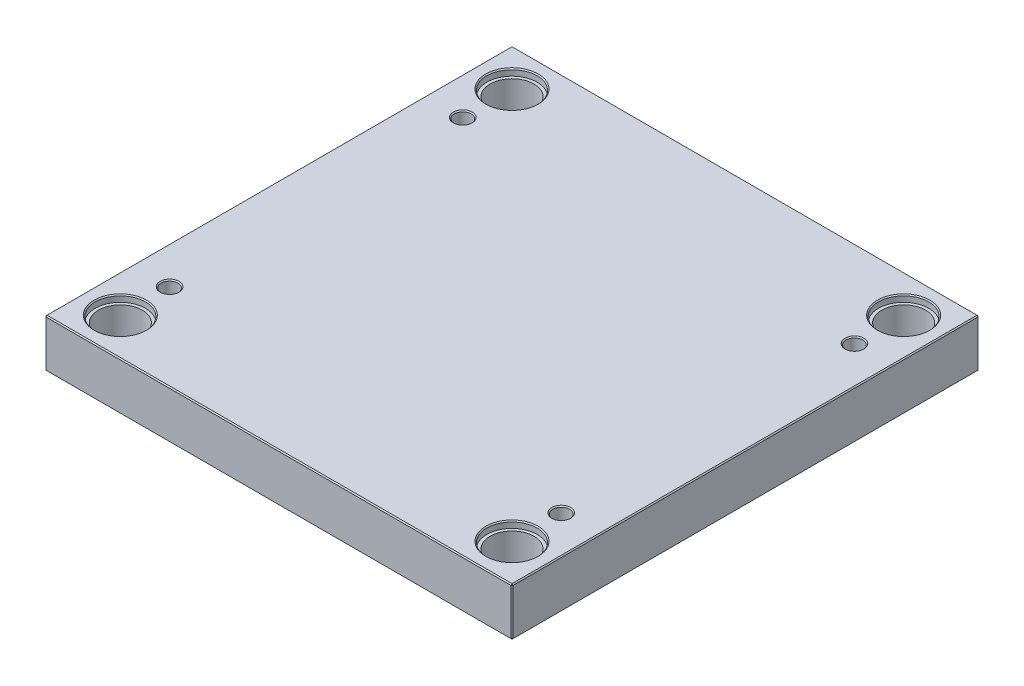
ISO-10303-21;
HEADER;
FILE_DESCRIPTION(('STEP AP214'),'2;1');
FILE_NAME('part.step','',(''),(''),'','','');
FILE_SCHEMA(('AUTOMOTIVE_DESIGN { 1 0 10303 214 1 1 1 1 }'));
ENDSEC;
DATA;
#1=APPLICATION_CONTEXT('core data for automotive mechanical design processes');
#2=APPLICATION_PROTOCOL_DEFINITION('international standard','automotive_design',2000,#1);
#3=PRODUCT_CONTEXT('',#1,'mechanical');
#4=PRODUCT('Part','Part','',(#3));
#5=PRODUCT_RELATED_PRODUCT_CATEGORY('part','',(#4));
#6=PRODUCT_DEFINITION_FORMATION('','',#4);
#7=PRODUCT_DEFINITION_CONTEXT('part definition',#1,'design');
#8=PRODUCT_DEFINITION('design','',#6,#7);
#9=PRODUCT_DEFINITION_SHAPE('','',#8);
#10=(LENGTH_UNIT() NAMED_UNIT(*) SI_UNIT(.MILLI.,.METRE.));
#11=(NAMED_UNIT(*) PLANE_ANGLE_UNIT() SI_UNIT($,.RADIAN.));
#12=(NAMED_UNIT(*) SI_UNIT($,.STERADIAN.) SOLID_ANGLE_UNIT());
#13=UNCERTAINTY_MEASURE_WITH_UNIT(LENGTH_MEASURE(1.E-05),#10,'distance_accuracy_value','');
#14=(GEOMETRIC_REPRESENTATION_CONTEXT(3) GLOBAL_UNCERTAINTY_ASSIGNED_CONTEXT((#13)) GLOBAL_UNIT_ASSIGNED_CONTEXT((#10,
#11,#12)) REPRESENTATION_CONTEXT('',''));
#15=CARTESIAN_POINT('',(0.,0.,0.));
#16=DIRECTION('',(0.,0.,1.));
#17=DIRECTION('',(1.,0.,0.));
#18=AXIS2_PLACEMENT_3D('',#15,#16,#17);
#19=CARTESIAN_POINT('',(-187.,0.,-187.));
#20=DIRECTION('',(0.,1.,0.));
#21=DIRECTION('',(0.,0.,1.));
#22=AXIS2_PLACEMENT_3D('',#19,#20,#21);
#23=CYLINDRICAL_SURFACE('',#22,21.);
#24=CARTESIAN_POINT('',(-187.,0.999999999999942,-187.));
#25=DIRECTION('',(0.,1.,0.));
#26=DIRECTION('',(0.,0.,1.));
#27=AXIS2_PLACEMENT_3D('',#24,#25,#26);
#28=CIRCLE('',#27,21.);
#29=CARTESIAN_POINT('',(-187.,0.999999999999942,-166.));
#30=VERTEX_POINT('',#29);
#31=EDGE_CURVE('E472',#30,#30,#28,.F.);
#32=ORIENTED_EDGE('',*,*,#31,.T.);
#33=EDGE_LOOP('',(#32));
#34=FACE_BOUND('',#33,.T.);
#35=CARTESIAN_POINT('',(-187.,39.7,-187.));
#36=DIRECTION('',(0.,1.,0.));
#37=DIRECTION('',(0.,0.,1.));
#38=AXIS2_PLACEMENT_3D('',#35,#36,#37);
#39=CIRCLE('',#38,21.);
#40=CARTESIAN_POINT('',(-187.,39.7,-166.));
#41=VERTEX_POINT('',#40);
#42=EDGE_CURVE('E221',#41,#41,#39,.F.);
#43=ORIENTED_EDGE('',*,*,#42,.F.);
#44=EDGE_LOOP('',(#43));
#45=FACE_BOUND('',#44,.T.);
#46=ADVANCED_FACE('F16',(#34,#45),#23,.F.);
#47=CARTESIAN_POINT('',(187.,0.,-187.));
#48=DIRECTION('',(0.,1.,0.));
#49=DIRECTION('',(0.,0.,1.));
#50=AXIS2_PLACEMENT_3D('',#47,#48,#49);
#51=CYLINDRICAL_SURFACE('',#50,21.);
#52=CARTESIAN_POINT('',(187.,0.999999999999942,-187.));
#53=DIRECTION('',(0.,1.,0.));
#54=DIRECTION('',(0.,0.,1.));
#55=AXIS2_PLACEMENT_3D('',#52,#53,#54);
#56=CIRCLE('',#55,21.);
#57=CARTESIAN_POINT('',(187.,0.999999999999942,-166.));
#58=VERTEX_POINT('',#57);
#59=EDGE_CURVE('E474',#58,#58,#56,.F.);
#60=ORIENTED_EDGE('',*,*,#59,.T.);
#61=EDGE_LOOP('',(#60));
#62=FACE_BOUND('',#61,.T.);
#63=CARTESIAN_POINT('',(187.,39.7,-187.));
#64=DIRECTION('',(0.,1.,0.));
#65=DIRECTION('',(0.,0.,1.));
#66=AXIS2_PLACEMENT_3D('',#63,#64,#65);
#67=CIRCLE('',#66,21.);
#68=CARTESIAN_POINT('',(187.,39.7,-166.));
#69=VERTEX_POINT('',#68);
#70=EDGE_CURVE('E218',#69,#69,#67,.F.);
#71=ORIENTED_EDGE('',*,*,#70,.F.);
#72=EDGE_LOOP('',(#71));
#73=FACE_BOUND('',#72,.T.);
#74=ADVANCED_FACE('F263',(#62,#73),#51,.F.);
#75=CARTESIAN_POINT('',(187.,0.,187.));
#76=DIRECTION('',(0.,1.,0.));
#77=DIRECTION('',(0.,0.,1.));
#78=AXIS2_PLACEMENT_3D('',#75,#76,#77);
#79=CYLINDRICAL_SURFACE('',#78,21.);
#80=CARTESIAN_POINT('',(187.,1.00000000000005,187.));
#81=DIRECTION('',(0.,1.,0.));
#82=DIRECTION('',(0.,0.,1.));
#83=AXIS2_PLACEMENT_3D('',#80,#81,#82);
#84=CIRCLE('',#83,21.);
#85=CARTESIAN_POINT('',(187.,1.00000000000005,208.));
#86=VERTEX_POINT('',#85);
#87=EDGE_CURVE('E477',#86,#86,#84,.F.);
#88=ORIENTED_EDGE('',*,*,#87,.T.);
#89=EDGE_LOOP('',(#88));
#90=FACE_BOUND('',#89,.T.);
#91=CARTESIAN_POINT('',(187.,39.7,187.));
#92=DIRECTION('',(0.,1.,0.));
#93=DIRECTION('',(0.,0.,1.));
#94=AXIS2_PLACEMENT_3D('',#91,#92,#93);
#95=CIRCLE('',#94,21.);
#96=CARTESIAN_POINT('',(187.,39.7,208.));
#97=VERTEX_POINT('',#96);
#98=EDGE_CURVE('E214',#97,#97,#95,.F.);
#99=ORIENTED_EDGE('',*,*,#98,.F.);
#100=EDGE_LOOP('',(#99));
#101=FACE_BOUND('',#100,.T.);
#102=ADVANCED_FACE('F270',(#90,#101),#79,.F.);
#103=CARTESIAN_POINT('',(-187.,0.,187.));
#104=DIRECTION('',(0.,1.,0.));
#105=DIRECTION('',(0.,0.,1.));
#106=AXIS2_PLACEMENT_3D('',#103,#104,#105);
#107=CYLINDRICAL_SURFACE('',#106,21.);
#108=CARTESIAN_POINT('',(-187.,1.00000000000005,187.));
#109=DIRECTION('',(0.,1.,0.));
#110=DIRECTION('',(0.,0.,1.));
#111=AXIS2_PLACEMENT_3D('',#108,#109,#110);
#112=CIRCLE('',#111,21.);
#113=CARTESIAN_POINT('',(-187.,1.00000000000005,208.));
#114=VERTEX_POINT('',#113);
#115=EDGE_CURVE('E480',#114,#114,#112,.F.);
#116=ORIENTED_EDGE('',*,*,#115,.T.);
#117=EDGE_LOOP('',(#116));
#118=FACE_BOUND('',#117,.T.);
#119=CARTESIAN_POINT('',(-187.,39.7,187.));
#120=DIRECTION('',(0.,1.,0.));
#121=DIRECTION('',(0.,0.,1.));
#122=AXIS2_PLACEMENT_3D('',#119,#120,#121);
#123=CIRCLE('',#122,21.);
#124=CARTESIAN_POINT('',(-187.,39.7,208.));
#125=VERTEX_POINT('',#124);
#126=EDGE_CURVE('E211',#125,#125,#123,.F.);
#127=ORIENTED_EDGE('',*,*,#126,.F.);
#128=EDGE_LOOP('',(#127));
#129=FACE_BOUND('',#128,.T.);
#130=ADVANCED_FACE('F277',(#118,#129),#107,.F.);
#131=CARTESIAN_POINT('',(-223.,46.,223.));
#132=DIRECTION('',(1.,0.,0.));
#133=DIRECTION('',(0.,0.,-1.));
#134=AXIS2_PLACEMENT_3D('',#131,#132,#133);
#135=PLANE('',#134);
#136=DIRECTION('',(0.,-1.,0.));
#137=VECTOR('',#136,1.);
#138=CARTESIAN_POINT('',(-223.,46.,-222.));
#139=LINE('',#138,#137);
#140=CARTESIAN_POINT('',(-223.,45.,-222.));
#141=VERTEX_POINT('',#140);
#142=CARTESIAN_POINT('',(-223.,1.,-222.));
#143=VERTEX_POINT('',#142);
#144=EDGE_CURVE('E487',#141,#143,#139,.T.);
#145=ORIENTED_EDGE('',*,*,#144,.T.);
#146=DIRECTION('',(0.,0.,1.));
#147=VECTOR('',#146,1.);
#148=CARTESIAN_POINT('',(-223.,1.,223.));
#149=LINE('',#148,#147);
#150=CARTESIAN_POINT('',(-223.,1.,222.));
#151=VERTEX_POINT('',#150);
#152=EDGE_CURVE('E490',#143,#151,#149,.T.);
#153=ORIENTED_EDGE('',*,*,#152,.T.);
#154=DIRECTION('',(0.,1.,0.));
#155=VECTOR('',#154,1.);
#156=CARTESIAN_POINT('',(-223.,46.,222.));
#157=LINE('',#156,#155);
#158=CARTESIAN_POINT('',(-223.,45.,222.));
#159=VERTEX_POINT('',#158);
#160=EDGE_CURVE('E485',#151,#159,#157,.T.);
#161=ORIENTED_EDGE('',*,*,#160,.T.);
#162=DIRECTION('',(0.,0.,-1.));
#163=VECTOR('',#162,1.);
#164=CARTESIAN_POINT('',(-223.,45.,-223.));
#165=LINE('',#164,#163);
#166=EDGE_CURVE('E483',#159,#141,#165,.T.);
#167=ORIENTED_EDGE('',*,*,#166,.T.);
#168=EDGE_LOOP('',(#145,#153,#161,#167));
#169=FACE_BOUND('',#168,.T.);
#170=ADVANCED_FACE('F298',(#169),#135,.F.);
#171=CARTESIAN_POINT('',(223.,46.,223.));
#172=DIRECTION('',(0.,0.,-1.));
#173=DIRECTION('',(-1.,0.,0.));
#174=AXIS2_PLACEMENT_3D('',#171,#172,#173);
#175=PLANE('',#174);
#176=DIRECTION('',(-1.,0.,0.));
#177=VECTOR('',#176,1.);
#178=CARTESIAN_POINT('',(-223.,45.,223.));
#179=LINE('',#178,#177);
#180=CARTESIAN_POINT('',(222.,45.,223.));
#181=VERTEX_POINT('',#180);
#182=CARTESIAN_POINT('',(-222.,45.,223.));
#183=VERTEX_POINT('',#182);
#184=EDGE_CURVE('E509',#181,#183,#179,.T.);
#185=ORIENTED_EDGE('',*,*,#184,.T.);
#186=DIRECTION('',(0.,-1.,0.));
#187=VECTOR('',#186,1.);
#188=CARTESIAN_POINT('',(-222.,46.,223.));
#189=LINE('',#188,#187);
#190=CARTESIAN_POINT('',(-222.,1.,223.));
#191=VERTEX_POINT('',#190);
#192=EDGE_CURVE('E515',#183,#191,#189,.T.);
#193=ORIENTED_EDGE('',*,*,#192,.T.);
#194=DIRECTION('',(1.,0.,0.));
#195=VECTOR('',#194,1.);
#196=CARTESIAN_POINT('',(223.,1.,223.));
#197=LINE('',#196,#195);
#198=CARTESIAN_POINT('',(222.,1.,223.));
#199=VERTEX_POINT('',#198);
#200=EDGE_CURVE('E513',#191,#199,#197,.T.);
#201=ORIENTED_EDGE('',*,*,#200,.T.);
#202=DIRECTION('',(0.,1.,0.));
#203=VECTOR('',#202,1.);
#204=CARTESIAN_POINT('',(222.,46.,223.));
#205=LINE('',#204,#203);
#206=EDGE_CURVE('E511',#199,#181,#205,.T.);
#207=ORIENTED_EDGE('',*,*,#206,.T.);
#208=EDGE_LOOP('',(#185,#193,#201,#207));
#209=FACE_BOUND('',#208,.T.);
#210=ADVANCED_FACE('F294',(#209),#175,.F.);
#211=CARTESIAN_POINT('',(223.,46.,223.));
#212=DIRECTION('',(-1.,0.,0.));
#213=DIRECTION('',(0.,0.,1.));
#214=AXIS2_PLACEMENT_3D('',#211,#212,#213);
#215=PLANE('',#214);
#216=DIRECTION('',(0.,0.,-1.));
#217=VECTOR('',#216,1.);
#218=CARTESIAN_POINT('',(223.,1.,223.));
#219=LINE('',#218,#217);
#220=CARTESIAN_POINT('',(223.,1.,222.));
#221=VERTEX_POINT('',#220);
#222=CARTESIAN_POINT('',(223.,1.,-222.));
#223=VERTEX_POINT('',#222);
#224=EDGE_CURVE('E504',#221,#223,#219,.T.);
#225=ORIENTED_EDGE('',*,*,#224,.T.);
#226=DIRECTION('',(0.,1.,0.));
#227=VECTOR('',#226,1.);
#228=CARTESIAN_POINT('',(223.,46.,-222.));
#229=LINE('',#228,#227);
#230=CARTESIAN_POINT('',(223.,45.,-222.));
#231=VERTEX_POINT('',#230);
#232=EDGE_CURVE('E506',#223,#231,#229,.T.);
#233=ORIENTED_EDGE('',*,*,#232,.T.);
#234=DIRECTION('',(0.,0.,1.));
#235=VECTOR('',#234,1.);
#236=CARTESIAN_POINT('',(223.,45.,223.));
#237=LINE('',#236,#235);
#238=CARTESIAN_POINT('',(223.,45.,222.));
#239=VERTEX_POINT('',#238);
#240=EDGE_CURVE('E500',#231,#239,#237,.T.);
#241=ORIENTED_EDGE('',*,*,#240,.T.);
#242=DIRECTION('',(0.,-1.,0.));
#243=VECTOR('',#242,1.);
#244=CARTESIAN_POINT('',(223.,46.,222.));
#245=LINE('',#244,#243);
#246=EDGE_CURVE('E502',#239,#221,#245,.T.);
#247=ORIENTED_EDGE('',*,*,#246,.T.);
#248=EDGE_LOOP('',(#225,#233,#241,#247));
#249=FACE_BOUND('',#248,.T.);
#250=ADVANCED_FACE('F290',(#249),#215,.F.);
#251=CARTESIAN_POINT('',(223.,46.,-223.));
#252=DIRECTION('',(0.,0.,1.));
#253=DIRECTION('',(1.,0.,0.));
#254=AXIS2_PLACEMENT_3D('',#251,#252,#253);
#255=PLANE('',#254);
#256=DIRECTION('',(0.,-1.,0.));
#257=VECTOR('',#256,1.);
#258=CARTESIAN_POINT('',(222.,46.,-223.));
#259=LINE('',#258,#257);
#260=CARTESIAN_POINT('',(222.,45.,-223.));
#261=VERTEX_POINT('',#260);
#262=CARTESIAN_POINT('',(222.,1.,-223.));
#263=VERTEX_POINT('',#262);
#264=EDGE_CURVE('E494',#261,#263,#259,.T.);
#265=ORIENTED_EDGE('',*,*,#264,.T.);
#266=DIRECTION('',(-1.,0.,0.));
#267=VECTOR('',#266,1.);
#268=CARTESIAN_POINT('',(223.,1.,-223.));
#269=LINE('',#268,#267);
#270=CARTESIAN_POINT('',(-222.,1.,-223.));
#271=VERTEX_POINT('',#270);
#272=EDGE_CURVE('E138',#263,#271,#269,.T.);
#273=ORIENTED_EDGE('',*,*,#272,.T.);
#274=DIRECTION('',(0.,1.,0.));
#275=VECTOR('',#274,1.);
#276=CARTESIAN_POINT('',(-222.,46.,-223.));
#277=LINE('',#276,#275);
#278=CARTESIAN_POINT('',(-222.,45.,-223.));
#279=VERTEX_POINT('',#278);
#280=EDGE_CURVE('E496',#271,#279,#277,.T.);
#281=ORIENTED_EDGE('',*,*,#280,.T.);
#282=DIRECTION('',(1.,0.,0.));
#283=VECTOR('',#282,1.);
#284=CARTESIAN_POINT('',(223.,45.,-223.));
#285=LINE('',#284,#283);
#286=EDGE_CURVE('E492',#279,#261,#285,.T.);
#287=ORIENTED_EDGE('',*,*,#286,.T.);
#288=EDGE_LOOP('',(#265,#273,#281,#287));
#289=FACE_BOUND('',#288,.T.);
#290=ADVANCED_FACE('F282',(#289),#255,.F.);
#291=CARTESIAN_POINT('',(0.,46.,0.));
#292=DIRECTION('',(0.,1.,0.));
#293=DIRECTION('',(0.,0.,1.));
#294=AXIS2_PLACEMENT_3D('',#291,#292,#293);
#295=PLANE('',#294);
#296=CARTESIAN_POINT('',(187.,46.,187.));
#297=DIRECTION('',(0.,1.,0.));
#298=DIRECTION('',(0.,0.,1.));
#299=AXIS2_PLACEMENT_3D('',#296,#297,#298);
#300=CIRCLE('',#299,25.);
#301=CARTESIAN_POINT('',(187.,46.,212.));
#302=VERTEX_POINT('',#301);
#303=EDGE_CURVE('E236',#302,#302,#300,.F.);
#304=ORIENTED_EDGE('',*,*,#303,.T.);
#305=EDGE_LOOP('',(#304));
#306=FACE_BOUND('',#305,.T.);
#307=CARTESIAN_POINT('',(-187.,46.,187.));
#308=DIRECTION('',(0.,1.,0.));
#309=DIRECTION('',(0.,0.,1.));
#310=AXIS2_PLACEMENT_3D('',#307,#308,#309);
#311=CIRCLE('',#310,25.);
#312=CARTESIAN_POINT('',(-187.,46.,212.));
#313=VERTEX_POINT('',#312);
#314=EDGE_CURVE('E233',#313,#313,#311,.F.);
#315=ORIENTED_EDGE('',*,*,#314,.T.);
#316=EDGE_LOOP('',(#315));
#317=FACE_BOUND('',#316,.T.);
#318=CARTESIAN_POINT('',(187.,46.,-187.));
#319=DIRECTION('',(0.,1.,0.));
#320=DIRECTION('',(0.,0.,1.));
#321=AXIS2_PLACEMENT_3D('',#318,#319,#320);
#322=CIRCLE('',#321,25.);
#323=CARTESIAN_POINT('',(187.,46.,-162.));
#324=VERTEX_POINT('',#323);
#325=EDGE_CURVE('E230',#324,#324,#322,.F.);
#326=ORIENTED_EDGE('',*,*,#325,.T.);
#327=EDGE_LOOP('',(#326));
#328=FACE_BOUND('',#327,.T.);
#329=CARTESIAN_POINT('',(-187.,46.,-187.));
#330=DIRECTION('',(0.,1.,0.));
#331=DIRECTION('',(0.,0.,1.));
#332=AXIS2_PLACEMENT_3D('',#329,#330,#331);
#333=CIRCLE('',#332,25.);
#334=CARTESIAN_POINT('',(-187.,46.,-162.));
#335=VERTEX_POINT('',#334);
#336=EDGE_CURVE('E227',#335,#335,#333,.F.);
#337=ORIENTED_EDGE('',*,*,#336,.T.);
#338=EDGE_LOOP('',(#337));
#339=FACE_BOUND('',#338,.T.);
#340=CARTESIAN_POINT('',(-187.,46.,140.));
#341=DIRECTION('',(0.,1.,0.));
#342=DIRECTION('',(0.,0.,1.));
#343=AXIS2_PLACEMENT_3D('',#340,#341,#342);
#344=CIRCLE('',#343,8.9999999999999);
#345=CARTESIAN_POINT('',(-187.,46.,149.));
#346=VERTEX_POINT('',#345);
#347=EDGE_CURVE('E198',#346,#346,#344,.F.);
#348=ORIENTED_EDGE('',*,*,#347,.T.);
#349=EDGE_LOOP('',(#348));
#350=FACE_BOUND('',#349,.T.);
#351=CARTESIAN_POINT('',(187.,46.,140.));
#352=DIRECTION('',(0.,1.,0.));
#353=DIRECTION('',(0.,0.,1.));
#354=AXIS2_PLACEMENT_3D('',#351,#352,#353);
#355=CIRCLE('',#354,8.9999999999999);
#356=CARTESIAN_POINT('',(187.,46.,149.));
#357=VERTEX_POINT('',#356);
#358=EDGE_CURVE('E195',#357,#357,#355,.F.);
#359=ORIENTED_EDGE('',*,*,#358,.T.);
#360=EDGE_LOOP('',(#359));
#361=FACE_BOUND('',#360,.T.);
#362=CARTESIAN_POINT('',(187.,46.,-140.));
#363=DIRECTION('',(0.,1.,0.));
#364=DIRECTION('',(0.,0.,1.));
#365=AXIS2_PLACEMENT_3D('',#362,#363,#364);
#366=CIRCLE('',#365,8.9999999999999);
#367=CARTESIAN_POINT('',(187.,46.,-131.));
#368=VERTEX_POINT('',#367);
#369=EDGE_CURVE('E192',#368,#368,#366,.F.);
#370=ORIENTED_EDGE('',*,*,#369,.T.);
#371=EDGE_LOOP('',(#370));
#372=FACE_BOUND('',#371,.T.);
#373=CARTESIAN_POINT('',(-187.,46.,-140.));
#374=DIRECTION('',(0.,1.,0.));
#375=DIRECTION('',(0.,0.,1.));
#376=AXIS2_PLACEMENT_3D('',#373,#374,#375);
#377=CIRCLE('',#376,8.9999999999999);
#378=CARTESIAN_POINT('',(-187.,46.,-131.));
#379=VERTEX_POINT('',#378);
#380=EDGE_CURVE('E188',#379,#379,#377,.F.);
#381=ORIENTED_EDGE('',*,*,#380,.T.);
#382=EDGE_LOOP('',(#381));
#383=FACE_BOUND('',#382,.T.);
#384=DIRECTION('',(0.,0.,-1.));
#385=VECTOR('',#384,1.);
#386=CARTESIAN_POINT('',(222.,46.,-223.));
#387=LINE('',#386,#385);
#388=CARTESIAN_POINT('',(222.,46.,222.));
#389=VERTEX_POINT('',#388);
#390=CARTESIAN_POINT('',(222.,46.,-222.));
#391=VERTEX_POINT('',#390);
#392=EDGE_CURVE('E31',#389,#391,#387,.T.);
#393=ORIENTED_EDGE('',*,*,#392,.T.);
#394=DIRECTION('',(-1.,0.,0.));
#395=VECTOR('',#394,1.);
#396=CARTESIAN_POINT('',(-223.,46.,-222.));
#397=LINE('',#396,#395);
#398=CARTESIAN_POINT('',(-222.,46.,-222.));
#399=VERTEX_POINT('',#398);
#400=EDGE_CURVE('E189',#391,#399,#397,.T.);
#401=ORIENTED_EDGE('',*,*,#400,.T.);
#402=DIRECTION('',(0.,0.,1.));
#403=VECTOR('',#402,1.);
#404=CARTESIAN_POINT('',(-222.,46.,223.));
#405=LINE('',#404,#403);
#406=CARTESIAN_POINT('',(-222.,46.,222.));
#407=VERTEX_POINT('',#406);
#408=EDGE_CURVE('E518',#399,#407,#405,.T.);
#409=ORIENTED_EDGE('',*,*,#408,.T.);
#410=DIRECTION('',(1.,0.,0.));
#411=VECTOR('',#410,1.);
#412=CARTESIAN_POINT('',(223.,46.,222.));
#413=LINE('',#412,#411);
#414=EDGE_CURVE('E36',#407,#389,#413,.T.);
#415=ORIENTED_EDGE('',*,*,#414,.T.);
#416=EDGE_LOOP('',(#393,#401,#409,#415));
#417=FACE_BOUND('',#416,.T.);
#418=ADVANCED_FACE('F279',(#306,#317,#328,#339,#350,#361,#372,#383,#417),#295,.T.);
#419=CARTESIAN_POINT('',(0.,0.,0.));
#420=DIRECTION('',(0.,1.,0.));
#421=DIRECTION('',(0.,0.,1.));
#422=AXIS2_PLACEMENT_3D('',#419,#420,#421);
#423=PLANE('',#422);
#424=CARTESIAN_POINT('',(-187.,0.,-187.));
#425=DIRECTION('',(0.,1.,0.));
#426=DIRECTION('',(0.,0.,1.));
#427=AXIS2_PLACEMENT_3D('',#424,#425,#426);
#428=CIRCLE('',#427,22.);
#429=CARTESIAN_POINT('',(-187.,0.,-165.));
#430=VERTEX_POINT('',#429);
#431=EDGE_CURVE('E469',#430,#430,#428,.T.);
#432=ORIENTED_EDGE('',*,*,#431,.T.);
#433=EDGE_LOOP('',(#432));
#434=FACE_BOUND('',#433,.T.);
#435=CARTESIAN_POINT('',(187.,0.,-187.));
#436=DIRECTION('',(0.,1.,0.));
#437=DIRECTION('',(0.,0.,1.));
#438=AXIS2_PLACEMENT_3D('',#435,#436,#437);
#439=CIRCLE('',#438,22.);
#440=CARTESIAN_POINT('',(187.,0.,-165.));
#441=VERTEX_POINT('',#440);
#442=EDGE_CURVE('E466',#441,#441,#439,.T.);
#443=ORIENTED_EDGE('',*,*,#442,.T.);
#444=EDGE_LOOP('',(#443));
#445=FACE_BOUND('',#444,.T.);
#446=CARTESIAN_POINT('',(187.,0.,187.));
#447=DIRECTION('',(0.,1.,0.));
#448=DIRECTION('',(0.,0.,1.));
#449=AXIS2_PLACEMENT_3D('',#446,#447,#448);
#450=CIRCLE('',#449,22.);
#451=CARTESIAN_POINT('',(187.,0.,209.));
#452=VERTEX_POINT('',#451);
#453=EDGE_CURVE('E463',#452,#452,#450,.T.);
#454=ORIENTED_EDGE('',*,*,#453,.T.);
#455=EDGE_LOOP('',(#454));
#456=FACE_BOUND('',#455,.T.);
#457=CARTESIAN_POINT('',(-187.,0.,187.));
#458=DIRECTION('',(0.,1.,0.));
#459=DIRECTION('',(0.,0.,1.));
#460=AXIS2_PLACEMENT_3D('',#457,#458,#459);
#461=CIRCLE('',#460,22.);
#462=CARTESIAN_POINT('',(-187.,0.,209.));
#463=VERTEX_POINT('',#462);
#464=EDGE_CURVE('E460',#463,#463,#461,.T.);
#465=ORIENTED_EDGE('',*,*,#464,.T.);
#466=EDGE_LOOP('',(#465));
#467=FACE_BOUND('',#466,.T.);
#468=DIRECTION('',(0.,0.,1.));
#469=VECTOR('',#468,1.);
#470=CARTESIAN_POINT('',(222.,0.,0.));
#471=LINE('',#470,#469);
#472=CARTESIAN_POINT('',(222.,0.,-222.));
#473=VERTEX_POINT('',#472);
#474=CARTESIAN_POINT('',(222.,0.,222.));
#475=VERTEX_POINT('',#474);
#476=EDGE_CURVE('E108',#473,#475,#471,.T.);
#477=ORIENTED_EDGE('',*,*,#476,.T.);
#478=DIRECTION('',(-1.,0.,0.));
#479=VECTOR('',#478,1.);
#480=CARTESIAN_POINT('',(0.,0.,222.));
#481=LINE('',#480,#479);
#482=CARTESIAN_POINT('',(-222.,0.,222.));
#483=VERTEX_POINT('',#482);
#484=EDGE_CURVE('E458',#475,#483,#481,.T.);
#485=ORIENTED_EDGE('',*,*,#484,.T.);
#486=DIRECTION('',(0.,0.,-1.));
#487=VECTOR('',#486,1.);
#488=CARTESIAN_POINT('',(-222.,0.,0.));
#489=LINE('',#488,#487);
#490=CARTESIAN_POINT('',(-222.,0.,-222.));
#491=VERTEX_POINT('',#490);
#492=EDGE_CURVE('E110',#483,#491,#489,.T.);
#493=ORIENTED_EDGE('',*,*,#492,.T.);
#494=DIRECTION('',(1.,0.,0.));
#495=VECTOR('',#494,1.);
#496=CARTESIAN_POINT('',(0.,0.,-222.));
#497=LINE('',#496,#495);
#498=EDGE_CURVE('E104',#491,#473,#497,.T.);
#499=ORIENTED_EDGE('',*,*,#498,.T.);
#500=EDGE_LOOP('',(#477,#485,#493,#499));
#501=FACE_BOUND('',#500,.T.);
#502=ADVANCED_FACE('F106',(#434,#445,#456,#467,#501),#423,.F.);
#503=CARTESIAN_POINT('',(-187.,0.,-187.));
#504=DIRECTION('',(0.,-1.,0.));
#505=DIRECTION('',(0.,0.,-1.));
#506=AXIS2_PLACEMENT_3D('',#503,#504,#505);
#507=CONICAL_SURFACE('',#506,22.,0.785398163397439);
#508=ORIENTED_EDGE('',*,*,#31,.F.);
#509=EDGE_LOOP('',(#508));
#510=FACE_BOUND('',#509,.T.);
#511=ORIENTED_EDGE('',*,*,#431,.F.);
#512=EDGE_LOOP('',(#511));
#513=FACE_BOUND('',#512,.T.);
#514=ADVANCED_FACE('F286',(#510,#513),#507,.F.);
#515=CARTESIAN_POINT('',(187.,0.,-187.));
#516=DIRECTION('',(0.,-1.,0.));
#517=DIRECTION('',(0.,0.,-1.));
#518=AXIS2_PLACEMENT_3D('',#515,#516,#517);
#519=CONICAL_SURFACE('',#518,22.,0.785398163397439);
#520=ORIENTED_EDGE('',*,*,#59,.F.);
#521=EDGE_LOOP('',(#520));
#522=FACE_BOUND('',#521,.T.);
#523=ORIENTED_EDGE('',*,*,#442,.F.);
#524=EDGE_LOOP('',(#523));
#525=FACE_BOUND('',#524,.T.);
#526=ADVANCED_FACE('F305',(#522,#525),#519,.F.);
#527=CARTESIAN_POINT('',(187.,0.,187.));
#528=DIRECTION('',(0.,-1.,0.));
#529=DIRECTION('',(0.,0.,-1.));
#530=AXIS2_PLACEMENT_3D('',#527,#528,#529);
#531=CONICAL_SURFACE('',#530,22.,0.785398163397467);
#532=ORIENTED_EDGE('',*,*,#87,.F.);
#533=EDGE_LOOP('',(#532));
#534=FACE_BOUND('',#533,.T.);
#535=ORIENTED_EDGE('',*,*,#453,.F.);
#536=EDGE_LOOP('',(#535));
#537=FACE_BOUND('',#536,.T.);
#538=ADVANCED_FACE('F309',(#534,#537),#531,.F.);
#539=CARTESIAN_POINT('',(-187.,0.,187.));
#540=DIRECTION('',(0.,-1.,0.));
#541=DIRECTION('',(0.,0.,-1.));
#542=AXIS2_PLACEMENT_3D('',#539,#540,#541);
#543=CONICAL_SURFACE('',#542,22.,0.785398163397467);
#544=ORIENTED_EDGE('',*,*,#115,.F.);
#545=EDGE_LOOP('',(#544));
#546=FACE_BOUND('',#545,.T.);
#547=ORIENTED_EDGE('',*,*,#464,.F.);
#548=EDGE_LOOP('',(#547));
#549=FACE_BOUND('',#548,.T.);
#550=ADVANCED_FACE('F313',(#546,#549),#543,.F.);
#551=CARTESIAN_POINT('',(223.,46.,222.));
#552=DIRECTION('',(-0.707106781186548,0.,-0.707106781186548));
#553=DIRECTION('',(0.,-1.,0.));
#554=AXIS2_PLACEMENT_3D('',#551,#552,#553);
#555=PLANE('',#554);
#556=DIRECTION('',(-0.707106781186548,0.,0.707106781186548));
#557=VECTOR('',#556,1.);
#558=CARTESIAN_POINT('',(222.,45.,223.));
#559=LINE('',#558,#557);
#560=EDGE_CURVE('E126',#181,#239,#559,.F.);
#561=ORIENTED_EDGE('',*,*,#560,.F.);
#562=ORIENTED_EDGE('',*,*,#206,.F.);
#563=DIRECTION('',(0.707106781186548,0.,-0.707106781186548));
#564=VECTOR('',#563,1.);
#565=CARTESIAN_POINT('',(222.,1.,223.));
#566=LINE('',#565,#564);
#567=EDGE_CURVE('E180',#221,#199,#566,.F.);
#568=ORIENTED_EDGE('',*,*,#567,.F.);
#569=ORIENTED_EDGE('',*,*,#246,.F.);
#570=EDGE_LOOP('',(#561,#562,#568,#569));
#571=FACE_BOUND('',#570,.T.);
#572=ADVANCED_FACE('F317',(#571),#555,.F.);
#573=CARTESIAN_POINT('',(222.,45.,223.));
#574=DIRECTION('',(0.577350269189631,0.577350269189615,0.577350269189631));
#575=DIRECTION('',(0.707106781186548,0.,-0.707106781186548));
#576=AXIS2_PLACEMENT_3D('',#573,#574,#575);
#577=PLANE('',#576);
#578=DIRECTION('',(0.,-0.707106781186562,0.707106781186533));
#579=VECTOR('',#578,1.);
#580=CARTESIAN_POINT('',(222.,45.,223.));
#581=LINE('',#580,#579);
#582=EDGE_CURVE('E175',#181,#389,#581,.F.);
#583=ORIENTED_EDGE('',*,*,#582,.F.);
#584=ORIENTED_EDGE('',*,*,#560,.T.);
#585=DIRECTION('',(-0.707106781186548,0.707106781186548,0.));
#586=VECTOR('',#585,1.);
#587=CARTESIAN_POINT('',(222.5,45.5,222.));
#588=LINE('',#587,#586);
#589=EDGE_CURVE('E177',#389,#239,#588,.F.);
#590=ORIENTED_EDGE('',*,*,#589,.F.);
#591=EDGE_LOOP('',(#583,#584,#590));
#592=FACE_BOUND('',#591,.T.);
#593=ADVANCED_FACE('F385',(#592),#577,.T.);
#594=CARTESIAN_POINT('',(222.,1.,223.));
#595=DIRECTION('',(0.577350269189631,-0.577350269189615,0.577350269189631));
#596=DIRECTION('',(0.707106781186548,0.,-0.707106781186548));
#597=AXIS2_PLACEMENT_3D('',#594,#595,#596);
#598=PLANE('',#597);
#599=DIRECTION('',(-0.707106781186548,-0.707106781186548,0.));
#600=VECTOR('',#599,1.);
#601=CARTESIAN_POINT('',(222.5,0.499999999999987,222.));
#602=LINE('',#601,#600);
#603=EDGE_CURVE('E124',#221,#475,#602,.T.);
#604=ORIENTED_EDGE('',*,*,#603,.F.);
#605=ORIENTED_EDGE('',*,*,#567,.T.);
#606=DIRECTION('',(0.,0.707106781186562,0.707106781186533));
#607=VECTOR('',#606,1.);
#608=CARTESIAN_POINT('',(222.,1.,223.));
#609=LINE('',#608,#607);
#610=EDGE_CURVE('E172',#475,#199,#609,.T.);
#611=ORIENTED_EDGE('',*,*,#610,.F.);
#612=EDGE_LOOP('',(#604,#605,#611));
#613=FACE_BOUND('',#612,.T.);
#614=ADVANCED_FACE('F381',(#613),#598,.T.);
#615=CARTESIAN_POINT('',(222.,46.,0.));
#616=DIRECTION('',(0.707106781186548,0.707106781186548,0.));
#617=DIRECTION('',(0.,0.,1.));
#618=AXIS2_PLACEMENT_3D('',#615,#616,#617);
#619=PLANE('',#618);
#620=ORIENTED_EDGE('',*,*,#589,.T.);
#621=ORIENTED_EDGE('',*,*,#240,.F.);
#622=DIRECTION('',(0.707106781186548,-0.707106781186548,0.));
#623=VECTOR('',#622,1.);
#624=CARTESIAN_POINT('',(223.,45.,-222.));
#625=LINE('',#624,#623);
#626=EDGE_CURVE('E166',#391,#231,#625,.T.);
#627=ORIENTED_EDGE('',*,*,#626,.F.);
#628=ORIENTED_EDGE('',*,*,#392,.F.);
#629=EDGE_LOOP('',(#620,#621,#627,#628));
#630=FACE_BOUND('',#629,.T.);
#631=ADVANCED_FACE('F377',(#630),#619,.T.);
#632=CARTESIAN_POINT('',(0.,46.,222.));
#633=DIRECTION('',(0.,0.707106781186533,0.707106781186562));
#634=DIRECTION('',(-1.,0.,0.));
#635=AXIS2_PLACEMENT_3D('',#632,#633,#634);
#636=PLANE('',#635);
#637=ORIENTED_EDGE('',*,*,#582,.T.);
#638=ORIENTED_EDGE('',*,*,#414,.F.);
#639=DIRECTION('',(0.,0.707106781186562,-0.707106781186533));
#640=VECTOR('',#639,1.);
#641=CARTESIAN_POINT('',(-222.,45.5,222.5));
#642=LINE('',#641,#640);
#643=EDGE_CURVE('E163',#183,#407,#642,.T.);
#644=ORIENTED_EDGE('',*,*,#643,.F.);
#645=ORIENTED_EDGE('',*,*,#184,.F.);
#646=EDGE_LOOP('',(#637,#638,#644,#645));
#647=FACE_BOUND('',#646,.T.);
#648=ADVANCED_FACE('F373',(#647),#636,.T.);
#649=CARTESIAN_POINT('',(-222.,46.,223.));
#650=DIRECTION('',(0.707106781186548,0.,-0.707106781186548));
#651=DIRECTION('',(0.,-1.,0.));
#652=AXIS2_PLACEMENT_3D('',#649,#650,#651);
#653=PLANE('',#652);
#654=DIRECTION('',(0.707106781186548,0.,0.707106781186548));
#655=VECTOR('',#654,1.);
#656=CARTESIAN_POINT('',(-222.,1.,223.));
#657=LINE('',#656,#655);
#658=EDGE_CURVE('E157',#191,#151,#657,.F.);
#659=ORIENTED_EDGE('',*,*,#658,.F.);
#660=ORIENTED_EDGE('',*,*,#192,.F.);
#661=DIRECTION('',(-0.707106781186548,0.,-0.707106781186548));
#662=VECTOR('',#661,1.);
#663=CARTESIAN_POINT('',(-223.,45.,222.));
#664=LINE('',#663,#662);
#665=EDGE_CURVE('E160',#159,#183,#664,.F.);
#666=ORIENTED_EDGE('',*,*,#665,.F.);
#667=ORIENTED_EDGE('',*,*,#160,.F.);
#668=EDGE_LOOP('',(#659,#660,#666,#667));
#669=FACE_BOUND('',#668,.T.);
#670=ADVANCED_FACE('F369',(#669),#653,.F.);
#671=CARTESIAN_POINT('',(223.,1.,223.));
#672=DIRECTION('',(0.,0.707106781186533,-0.707106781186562));
#673=DIRECTION('',(1.,0.,0.));
#674=AXIS2_PLACEMENT_3D('',#671,#672,#673);
#675=PLANE('',#674);
#676=ORIENTED_EDGE('',*,*,#610,.T.);
#677=ORIENTED_EDGE('',*,*,#200,.F.);
#678=DIRECTION('',(0.,-0.707106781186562,-0.707106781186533));
#679=VECTOR('',#678,1.);
#680=CARTESIAN_POINT('',(-222.,1.,223.));
#681=LINE('',#680,#679);
#682=EDGE_CURVE('E135',#483,#191,#681,.F.);
#683=ORIENTED_EDGE('',*,*,#682,.F.);
#684=ORIENTED_EDGE('',*,*,#484,.F.);
#685=EDGE_LOOP('',(#676,#677,#683,#684));
#686=FACE_BOUND('',#685,.T.);
#687=ADVANCED_FACE('F366',(#686),#675,.F.);
#688=CARTESIAN_POINT('',(223.,1.,223.));
#689=DIRECTION('',(-0.707106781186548,0.707106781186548,0.));
#690=DIRECTION('',(0.,0.,-1.));
#691=AXIS2_PLACEMENT_3D('',#688,#689,#690);
#692=PLANE('',#691);
#693=ORIENTED_EDGE('',*,*,#603,.T.);
#694=ORIENTED_EDGE('',*,*,#476,.F.);
#695=DIRECTION('',(0.707106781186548,0.707106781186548,0.));
#696=VECTOR('',#695,1.);
#697=CARTESIAN_POINT('',(222.5,0.499999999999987,-222.));
#698=LINE('',#697,#696);
#699=EDGE_CURVE('E121',#223,#473,#698,.F.);
#700=ORIENTED_EDGE('',*,*,#699,.F.);
#701=ORIENTED_EDGE('',*,*,#224,.F.);
#702=EDGE_LOOP('',(#693,#694,#700,#701));
#703=FACE_BOUND('',#702,.T.);
#704=ADVANCED_FACE('F119',(#703),#692,.F.);
#705=CARTESIAN_POINT('',(222.,46.,-223.));
#706=DIRECTION('',(-0.707106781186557,0.,0.707106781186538));
#707=DIRECTION('',(0.,-1.,0.));
#708=AXIS2_PLACEMENT_3D('',#705,#706,#707);
#709=PLANE('',#708);
#710=DIRECTION('',(0.707106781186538,0.,0.707106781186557));
#711=VECTOR('',#710,1.);
#712=CARTESIAN_POINT('',(223.,45.,-222.));
#713=LINE('',#712,#711);
#714=EDGE_CURVE('E168',#231,#261,#713,.F.);
#715=ORIENTED_EDGE('',*,*,#714,.F.);
#716=ORIENTED_EDGE('',*,*,#232,.F.);
#717=DIRECTION('',(-0.707106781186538,0.,-0.707106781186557));
#718=VECTOR('',#717,1.);
#719=CARTESIAN_POINT('',(222.,1.,-223.));
#720=LINE('',#719,#718);
#721=EDGE_CURVE('E134',#263,#223,#720,.F.);
#722=ORIENTED_EDGE('',*,*,#721,.F.);
#723=ORIENTED_EDGE('',*,*,#264,.F.);
#724=EDGE_LOOP('',(#715,#716,#722,#723));
#725=FACE_BOUND('',#724,.T.);
#726=ADVANCED_FACE('F359',(#725),#709,.F.);
#727=CARTESIAN_POINT('',(223.,45.,-222.));
#728=DIRECTION('',(0.577350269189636,0.57735026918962,-0.57735026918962));
#729=DIRECTION('',(-0.707106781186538,0.,-0.707106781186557));
#730=AXIS2_PLACEMENT_3D('',#727,#728,#729);
#731=PLANE('',#730);
#732=ORIENTED_EDGE('',*,*,#626,.T.);
#733=ORIENTED_EDGE('',*,*,#714,.T.);
#734=DIRECTION('',(0.,0.707106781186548,0.707106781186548));
#735=VECTOR('',#734,1.);
#736=CARTESIAN_POINT('',(222.,45.5,-222.5));
#737=LINE('',#736,#735);
#738=EDGE_CURVE('E152',#391,#261,#737,.F.);
#739=ORIENTED_EDGE('',*,*,#738,.F.);
#740=EDGE_LOOP('',(#732,#733,#739));
#741=FACE_BOUND('',#740,.T.);
#742=ADVANCED_FACE('F355',(#741),#731,.T.);
#743=CARTESIAN_POINT('',(-223.,45.,222.));
#744=DIRECTION('',(-0.577350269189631,0.577350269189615,0.577350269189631));
#745=DIRECTION('',(0.707106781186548,0.,0.707106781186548));
#746=AXIS2_PLACEMENT_3D('',#743,#744,#745);
#747=PLANE('',#746);
#748=ORIENTED_EDGE('',*,*,#665,.T.);
#749=ORIENTED_EDGE('',*,*,#643,.T.);
#750=DIRECTION('',(-0.707106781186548,-0.707106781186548,0.));
#751=VECTOR('',#750,1.);
#752=CARTESIAN_POINT('',(-223.,45.,222.));
#753=LINE('',#752,#751);
#754=EDGE_CURVE('E143',#159,#407,#753,.F.);
#755=ORIENTED_EDGE('',*,*,#754,.F.);
#756=EDGE_LOOP('',(#748,#749,#755));
#757=FACE_BOUND('',#756,.T.);
#758=ADVANCED_FACE('F351',(#757),#747,.T.);
#759=CARTESIAN_POINT('',(-222.,1.,223.));
#760=DIRECTION('',(-0.577350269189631,-0.577350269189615,0.577350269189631));
#761=DIRECTION('',(0.707106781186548,0.,0.707106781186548));
#762=AXIS2_PLACEMENT_3D('',#759,#760,#761);
#763=PLANE('',#762);
#764=ORIENTED_EDGE('',*,*,#682,.T.);
#765=ORIENTED_EDGE('',*,*,#658,.T.);
#766=DIRECTION('',(-0.707106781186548,0.707106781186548,0.));
#767=VECTOR('',#766,1.);
#768=CARTESIAN_POINT('',(-222.5,0.499999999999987,222.));
#769=LINE('',#768,#767);
#770=EDGE_CURVE('E139',#483,#151,#769,.T.);
#771=ORIENTED_EDGE('',*,*,#770,.F.);
#772=EDGE_LOOP('',(#764,#765,#771));
#773=FACE_BOUND('',#772,.T.);
#774=ADVANCED_FACE('F348',(#773),#763,.T.);
#775=CARTESIAN_POINT('',(222.,1.,-223.));
#776=DIRECTION('',(0.577350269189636,-0.57735026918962,-0.57735026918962));
#777=DIRECTION('',(-0.707106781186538,0.,-0.707106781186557));
#778=AXIS2_PLACEMENT_3D('',#775,#776,#777);
#779=PLANE('',#778);
#780=ORIENTED_EDGE('',*,*,#721,.T.);
#781=ORIENTED_EDGE('',*,*,#699,.T.);
#782=DIRECTION('',(0.,-0.707106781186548,0.707106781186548));
#783=VECTOR('',#782,1.);
#784=CARTESIAN_POINT('',(222.,1.,-223.));
#785=LINE('',#784,#783);
#786=EDGE_CURVE('E131',#263,#473,#785,.T.);
#787=ORIENTED_EDGE('',*,*,#786,.F.);
#788=EDGE_LOOP('',(#780,#781,#787));
#789=FACE_BOUND('',#788,.T.);
#790=ADVANCED_FACE('F130',(#789),#779,.T.);
#791=CARTESIAN_POINT('',(0.,46.,-222.));
#792=DIRECTION('',(0.,0.707106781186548,-0.707106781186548));
#793=DIRECTION('',(1.,0.,0.));
#794=AXIS2_PLACEMENT_3D('',#791,#792,#793);
#795=PLANE('',#794);
#796=ORIENTED_EDGE('',*,*,#738,.T.);
#797=ORIENTED_EDGE('',*,*,#286,.F.);
#798=DIRECTION('',(0.,-0.707106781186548,-0.707106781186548));
#799=VECTOR('',#798,1.);
#800=CARTESIAN_POINT('',(-222.,45.,-223.));
#801=LINE('',#800,#799);
#802=EDGE_CURVE('E140',#399,#279,#801,.T.);
#803=ORIENTED_EDGE('',*,*,#802,.F.);
#804=ORIENTED_EDGE('',*,*,#400,.F.);
#805=EDGE_LOOP('',(#796,#797,#803,#804));
#806=FACE_BOUND('',#805,.T.);
#807=ADVANCED_FACE('F341',(#806),#795,.T.);
#808=CARTESIAN_POINT('',(-222.,46.,0.));
#809=DIRECTION('',(-0.707106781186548,0.707106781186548,0.));
#810=DIRECTION('',(0.,0.,-1.));
#811=AXIS2_PLACEMENT_3D('',#808,#809,#810);
#812=PLANE('',#811);
#813=ORIENTED_EDGE('',*,*,#754,.T.);
#814=ORIENTED_EDGE('',*,*,#408,.F.);
#815=DIRECTION('',(0.707106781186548,0.707106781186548,0.));
#816=VECTOR('',#815,1.);
#817=CARTESIAN_POINT('',(-222.5,45.5,-222.));
#818=LINE('',#817,#816);
#819=EDGE_CURVE('E146',#141,#399,#818,.T.);
#820=ORIENTED_EDGE('',*,*,#819,.F.);
#821=ORIENTED_EDGE('',*,*,#166,.F.);
#822=EDGE_LOOP('',(#813,#814,#820,#821));
#823=FACE_BOUND('',#822,.T.);
#824=ADVANCED_FACE('F337',(#823),#812,.T.);
#825=CARTESIAN_POINT('',(-223.,1.,223.));
#826=DIRECTION('',(0.707106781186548,0.707106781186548,0.));
#827=DIRECTION('',(0.,0.,1.));
#828=AXIS2_PLACEMENT_3D('',#825,#826,#827);
#829=PLANE('',#828);
#830=ORIENTED_EDGE('',*,*,#770,.T.);
#831=ORIENTED_EDGE('',*,*,#152,.F.);
#832=DIRECTION('',(0.707106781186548,-0.707106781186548,0.));
#833=VECTOR('',#832,1.);
#834=CARTESIAN_POINT('',(-223.,1.,-222.));
#835=LINE('',#834,#833);
#836=EDGE_CURVE('E529',#491,#143,#835,.F.);
#837=ORIENTED_EDGE('',*,*,#836,.F.);
#838=ORIENTED_EDGE('',*,*,#492,.F.);
#839=EDGE_LOOP('',(#830,#831,#837,#838));
#840=FACE_BOUND('',#839,.T.);
#841=ADVANCED_FACE('F334',(#840),#829,.F.);
#842=CARTESIAN_POINT('',(223.,1.,-223.));
#843=DIRECTION('',(0.,0.707106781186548,0.707106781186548));
#844=DIRECTION('',(-1.,0.,0.));
#845=AXIS2_PLACEMENT_3D('',#842,#843,#844);
#846=PLANE('',#845);
#847=ORIENTED_EDGE('',*,*,#786,.T.);
#848=ORIENTED_EDGE('',*,*,#498,.F.);
#849=DIRECTION('',(0.,0.707106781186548,-0.707106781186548));
#850=VECTOR('',#849,1.);
#851=CARTESIAN_POINT('',(-222.,0.5,-222.5));
#852=LINE('',#851,#850);
#853=EDGE_CURVE('E526',#271,#491,#852,.F.);
#854=ORIENTED_EDGE('',*,*,#853,.F.);
#855=ORIENTED_EDGE('',*,*,#272,.F.);
#856=EDGE_LOOP('',(#847,#848,#854,#855));
#857=FACE_BOUND('',#856,.T.);
#858=ADVANCED_FACE('F137',(#857),#846,.F.);
#859=CARTESIAN_POINT('',(-222.,45.,-223.));
#860=DIRECTION('',(-0.577350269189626,0.577350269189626,-0.577350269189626));
#861=DIRECTION('',(-0.707106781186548,0.,0.707106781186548));
#862=AXIS2_PLACEMENT_3D('',#859,#860,#861);
#863=PLANE('',#862);
#864=ORIENTED_EDGE('',*,*,#819,.T.);
#865=ORIENTED_EDGE('',*,*,#802,.T.);
#866=DIRECTION('',(0.707106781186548,0.,-0.707106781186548));
#867=VECTOR('',#866,1.);
#868=CARTESIAN_POINT('',(-222.,45.,-223.));
#869=LINE('',#868,#867);
#870=EDGE_CURVE('E524',#141,#279,#869,.T.);
#871=ORIENTED_EDGE('',*,*,#870,.F.);
#872=EDGE_LOOP('',(#864,#865,#871));
#873=FACE_BOUND('',#872,.T.);
#874=ADVANCED_FACE('F327',(#873),#863,.T.);
#875=CARTESIAN_POINT('',(-223.,1.,-222.));
#876=DIRECTION('',(-0.577350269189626,-0.577350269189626,-0.577350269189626));
#877=DIRECTION('',(-0.707106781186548,0.,0.707106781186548));
#878=AXIS2_PLACEMENT_3D('',#875,#876,#877);
#879=PLANE('',#878);
#880=ORIENTED_EDGE('',*,*,#853,.T.);
#881=ORIENTED_EDGE('',*,*,#836,.T.);
#882=DIRECTION('',(-0.707106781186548,0.,0.707106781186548));
#883=VECTOR('',#882,1.);
#884=CARTESIAN_POINT('',(-223.,1.,-222.));
#885=LINE('',#884,#883);
#886=EDGE_CURVE('E455',#271,#143,#885,.T.);
#887=ORIENTED_EDGE('',*,*,#886,.F.);
#888=EDGE_LOOP('',(#880,#881,#887));
#889=FACE_BOUND('',#888,.T.);
#890=ADVANCED_FACE('F323',(#889),#879,.T.);
#891=CARTESIAN_POINT('',(-223.,46.,-222.));
#892=DIRECTION('',(0.707106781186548,0.,0.707106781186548));
#893=DIRECTION('',(0.,-1.,0.));
#894=AXIS2_PLACEMENT_3D('',#891,#892,#893);
#895=PLANE('',#894);
#896=ORIENTED_EDGE('',*,*,#870,.T.);
#897=ORIENTED_EDGE('',*,*,#280,.F.);
#898=ORIENTED_EDGE('',*,*,#886,.T.);
#899=ORIENTED_EDGE('',*,*,#144,.F.);
#900=EDGE_LOOP('',(#896,#897,#898,#899));
#901=FACE_BOUND('',#900,.T.);
#902=ADVANCED_FACE('F319',(#901),#895,.F.);
#903=CARTESIAN_POINT('',(-187.,21.,-140.));
#904=DIRECTION('',(0.,1.,0.));
#905=DIRECTION('',(0.,0.,1.));
#906=AXIS2_PLACEMENT_3D('',#903,#904,#905);
#907=CYLINDRICAL_SURFACE('',#906,8.);
#908=CARTESIAN_POINT('',(-187.,45.,-140.));
#909=DIRECTION('',(0.,1.,0.));
#910=DIRECTION('',(0.,0.,1.));
#911=AXIS2_PLACEMENT_3D('',#908,#909,#910);
#912=CIRCLE('',#911,8.);
#913=CARTESIAN_POINT('',(-187.,45.,-132.));
#914=VERTEX_POINT('',#913);
#915=EDGE_CURVE('E207',#914,#914,#912,.T.);
#916=ORIENTED_EDGE('',*,*,#915,.T.);
#917=EDGE_LOOP('',(#916));
#918=FACE_BOUND('',#917,.T.);
#919=CARTESIAN_POINT('',(-187.,21.,-140.));
#920=DIRECTION('',(0.,1.,0.));
#921=DIRECTION('',(0.,0.,1.));
#922=AXIS2_PLACEMENT_3D('',#919,#920,#921);
#923=CIRCLE('',#922,8.);
#924=CARTESIAN_POINT('',(-187.,21.,-132.));
#925=VERTEX_POINT('',#924);
#926=EDGE_CURVE('E448',#925,#925,#923,.T.);
#927=ORIENTED_EDGE('',*,*,#926,.F.);
#928=EDGE_LOOP('',(#927));
#929=FACE_BOUND('',#928,.T.);
#930=ADVANCED_FACE('F322',(#918,#929),#907,.F.);
#931=CARTESIAN_POINT('',(-187.,21.,-140.));
#932=DIRECTION('',(0.,1.,0.));
#933=DIRECTION('',(0.,0.,1.));
#934=AXIS2_PLACEMENT_3D('',#931,#932,#933);
#935=PLANE('',#934);
#936=ORIENTED_EDGE('',*,*,#926,.T.);
#937=EDGE_LOOP('',(#936));
#938=FACE_BOUND('',#937,.T.);
#939=ADVANCED_FACE('F596',(#938),#935,.T.);
#940=CARTESIAN_POINT('',(187.,21.,-140.));
#941=DIRECTION('',(0.,1.,0.));
#942=DIRECTION('',(0.,0.,1.));
#943=AXIS2_PLACEMENT_3D('',#940,#941,#942);
#944=CYLINDRICAL_SURFACE('',#943,8.);
#945=CARTESIAN_POINT('',(187.,45.,-140.));
#946=DIRECTION('',(0.,1.,0.));
#947=DIRECTION('',(0.,0.,1.));
#948=AXIS2_PLACEMENT_3D('',#945,#946,#947);
#949=CIRCLE('',#948,8.);
#950=CARTESIAN_POINT('',(187.,45.,-132.));
#951=VERTEX_POINT('',#950);
#952=EDGE_CURVE('E204',#951,#951,#949,.T.);
#953=ORIENTED_EDGE('',*,*,#952,.T.);
#954=EDGE_LOOP('',(#953));
#955=FACE_BOUND('',#954,.T.);
#956=CARTESIAN_POINT('',(187.,21.,-140.));
#957=DIRECTION('',(0.,1.,0.));
#958=DIRECTION('',(0.,0.,1.));
#959=AXIS2_PLACEMENT_3D('',#956,#957,#958);
#960=CIRCLE('',#959,8.);
#961=CARTESIAN_POINT('',(187.,21.,-132.));
#962=VERTEX_POINT('',#961);
#963=EDGE_CURVE('E445',#962,#962,#960,.T.);
#964=ORIENTED_EDGE('',*,*,#963,.F.);
#965=EDGE_LOOP('',(#964));
#966=FACE_BOUND('',#965,.T.);
#967=ADVANCED_FACE('F592',(#955,#966),#944,.F.);
#968=CARTESIAN_POINT('',(187.,21.,-140.));
#969=DIRECTION('',(0.,1.,0.));
#970=DIRECTION('',(0.,0.,1.));
#971=AXIS2_PLACEMENT_3D('',#968,#969,#970);
#972=PLANE('',#971);
#973=ORIENTED_EDGE('',*,*,#963,.T.);
#974=EDGE_LOOP('',(#973));
#975=FACE_BOUND('',#974,.T.);
#976=ADVANCED_FACE('F588',(#975),#972,.T.);
#977=CARTESIAN_POINT('',(187.,21.,140.));
#978=DIRECTION('',(0.,1.,0.));
#979=DIRECTION('',(0.,0.,1.));
#980=AXIS2_PLACEMENT_3D('',#977,#978,#979);
#981=CYLINDRICAL_SURFACE('',#980,8.);
#982=CARTESIAN_POINT('',(187.,45.,140.));
#983=DIRECTION('',(0.,1.,0.));
#984=DIRECTION('',(0.,0.,1.));
#985=AXIS2_PLACEMENT_3D('',#982,#983,#984);
#986=CIRCLE('',#985,8.);
#987=CARTESIAN_POINT('',(187.,45.,148.));
#988=VERTEX_POINT('',#987);
#989=EDGE_CURVE('E201',#988,#988,#986,.T.);
#990=ORIENTED_EDGE('',*,*,#989,.T.);
#991=EDGE_LOOP('',(#990));
#992=FACE_BOUND('',#991,.T.);
#993=CARTESIAN_POINT('',(187.,21.,140.));
#994=DIRECTION('',(0.,1.,0.));
#995=DIRECTION('',(0.,0.,1.));
#996=AXIS2_PLACEMENT_3D('',#993,#994,#995);
#997=CIRCLE('',#996,8.);
#998=CARTESIAN_POINT('',(187.,21.,148.));
#999=VERTEX_POINT('',#998);
#1000=EDGE_CURVE('E449',#999,#999,#997,.T.);
#1001=ORIENTED_EDGE('',*,*,#1000,.F.);
#1002=EDGE_LOOP('',(#1001));
#1003=FACE_BOUND('',#1002,.T.);
#1004=ADVANCED_FACE('F591',(#992,#1003),#981,.F.);
#1005=CARTESIAN_POINT('',(187.,21.,140.));
#1006=DIRECTION('',(0.,1.,0.));
#1007=DIRECTION('',(0.,0.,1.));
#1008=AXIS2_PLACEMENT_3D('',#1005,#1006,#1007);
#1009=PLANE('',#1008);
#1010=ORIENTED_EDGE('',*,*,#1000,.T.);
#1011=EDGE_LOOP('',(#1010));
#1012=FACE_BOUND('',#1011,.T.);
#1013=ADVANCED_FACE('F598',(#1012),#1009,.T.);
#1014=CARTESIAN_POINT('',(-187.,21.,140.));
#1015=DIRECTION('',(0.,1.,0.));
#1016=DIRECTION('',(0.,0.,1.));
#1017=AXIS2_PLACEMENT_3D('',#1014,#1015,#1016);
#1018=CYLINDRICAL_SURFACE('',#1017,8.);
#1019=CARTESIAN_POINT('',(-187.,45.,140.));
#1020=DIRECTION('',(0.,1.,0.));
#1021=DIRECTION('',(0.,0.,1.));
#1022=AXIS2_PLACEMENT_3D('',#1019,#1020,#1021);
#1023=CIRCLE('',#1022,8.);
#1024=CARTESIAN_POINT('',(-187.,45.,148.));
#1025=VERTEX_POINT('',#1024);
#1026=EDGE_CURVE('E185',#1025,#1025,#1023,.T.);
#1027=ORIENTED_EDGE('',*,*,#1026,.T.);
#1028=EDGE_LOOP('',(#1027));
#1029=FACE_BOUND('',#1028,.T.);
#1030=CARTESIAN_POINT('',(-187.,21.,140.));
#1031=DIRECTION('',(0.,1.,0.));
#1032=DIRECTION('',(0.,0.,1.));
#1033=AXIS2_PLACEMENT_3D('',#1030,#1031,#1032);
#1034=CIRCLE('',#1033,8.);
#1035=CARTESIAN_POINT('',(-187.,21.,148.));
#1036=VERTEX_POINT('',#1035);
#1037=EDGE_CURVE('E224',#1036,#1036,#1034,.T.);
#1038=ORIENTED_EDGE('',*,*,#1037,.F.);
#1039=EDGE_LOOP('',(#1038));
#1040=FACE_BOUND('',#1039,.T.);
#1041=ADVANCED_FACE('F601',(#1029,#1040),#1018,.F.);
#1042=CARTESIAN_POINT('',(-187.,21.,140.));
#1043=DIRECTION('',(0.,1.,0.));
#1044=DIRECTION('',(0.,0.,1.));
#1045=AXIS2_PLACEMENT_3D('',#1042,#1043,#1044);
#1046=PLANE('',#1045);
#1047=ORIENTED_EDGE('',*,*,#1037,.T.);
#1048=EDGE_LOOP('',(#1047));
#1049=FACE_BOUND('',#1048,.T.);
#1050=ADVANCED_FACE('F397',(#1049),#1046,.T.);
#1051=CARTESIAN_POINT('',(-187.,45.,140.));
#1052=DIRECTION('',(0.,1.,0.));
#1053=DIRECTION('',(0.,0.,1.));
#1054=AXIS2_PLACEMENT_3D('',#1051,#1052,#1053);
#1055=CONICAL_SURFACE('',#1054,8.,0.785398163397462);
#1056=ORIENTED_EDGE('',*,*,#347,.F.);
#1057=EDGE_LOOP('',(#1056));
#1058=FACE_BOUND('',#1057,.T.);
#1059=ORIENTED_EDGE('',*,*,#1026,.F.);
#1060=EDGE_LOOP('',(#1059));
#1061=FACE_BOUND('',#1060,.T.);
#1062=ADVANCED_FACE('F393',(#1058,#1061),#1055,.F.);
#1063=CARTESIAN_POINT('',(187.,45.,140.));
#1064=DIRECTION('',(0.,1.,0.));
#1065=DIRECTION('',(0.,0.,1.));
#1066=AXIS2_PLACEMENT_3D('',#1063,#1064,#1065);
#1067=CONICAL_SURFACE('',#1066,8.,0.785398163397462);
#1068=ORIENTED_EDGE('',*,*,#358,.F.);
#1069=EDGE_LOOP('',(#1068));
#1070=FACE_BOUND('',#1069,.T.);
#1071=ORIENTED_EDGE('',*,*,#989,.F.);
#1072=EDGE_LOOP('',(#1071));
#1073=FACE_BOUND('',#1072,.T.);
#1074=ADVANCED_FACE('F396',(#1070,#1073),#1067,.F.);
#1075=CARTESIAN_POINT('',(187.,45.,-140.));
#1076=DIRECTION('',(0.,1.,0.));
#1077=DIRECTION('',(0.,0.,1.));
#1078=AXIS2_PLACEMENT_3D('',#1075,#1076,#1077);
#1079=CONICAL_SURFACE('',#1078,8.,0.785398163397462);
#1080=ORIENTED_EDGE('',*,*,#369,.F.);
#1081=EDGE_LOOP('',(#1080));
#1082=FACE_BOUND('',#1081,.T.);
#1083=ORIENTED_EDGE('',*,*,#952,.F.);
#1084=EDGE_LOOP('',(#1083));
#1085=FACE_BOUND('',#1084,.T.);
#1086=ADVANCED_FACE('F401',(#1082,#1085),#1079,.F.);
#1087=CARTESIAN_POINT('',(-187.,45.,-140.));
#1088=DIRECTION('',(0.,1.,0.));
#1089=DIRECTION('',(0.,0.,1.));
#1090=AXIS2_PLACEMENT_3D('',#1087,#1088,#1089);
#1091=CONICAL_SURFACE('',#1090,8.,0.785398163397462);
#1092=ORIENTED_EDGE('',*,*,#380,.F.);
#1093=EDGE_LOOP('',(#1092));
#1094=FACE_BOUND('',#1093,.T.);
#1095=ORIENTED_EDGE('',*,*,#915,.F.);
#1096=EDGE_LOOP('',(#1095));
#1097=FACE_BOUND('',#1096,.T.);
#1098=ADVANCED_FACE('F405',(#1094,#1097),#1091,.F.);
#1099=CARTESIAN_POINT('',(-187.,39.7,187.));
#1100=DIRECTION('',(0.,1.,0.));
#1101=DIRECTION('',(0.,0.,1.));
#1102=AXIS2_PLACEMENT_3D('',#1099,#1100,#1101);
#1103=PLANE('',#1102);
#1104=CARTESIAN_POINT('',(-187.,39.7,187.));
#1105=DIRECTION('',(0.,1.,0.));
#1106=DIRECTION('',(0.,0.,1.));
#1107=AXIS2_PLACEMENT_3D('',#1104,#1105,#1106);
#1108=CIRCLE('',#1107,24.);
#1109=CARTESIAN_POINT('',(-187.,39.7,211.));
#1110=VERTEX_POINT('',#1109);
#1111=EDGE_CURVE('E436',#1110,#1110,#1108,.T.);
#1112=ORIENTED_EDGE('',*,*,#1111,.T.);
#1113=EDGE_LOOP('',(#1112));
#1114=FACE_BOUND('',#1113,.T.);
#1115=ORIENTED_EDGE('',*,*,#126,.T.);
#1116=EDGE_LOOP('',(#1115));
#1117=FACE_BOUND('',#1116,.T.);
#1118=ADVANCED_FACE('F409',(#1114,#1117),#1103,.T.);
#1119=CARTESIAN_POINT('',(-187.,39.7,187.));
#1120=DIRECTION('',(0.,1.,0.));
#1121=DIRECTION('',(0.,0.,1.));
#1122=AXIS2_PLACEMENT_3D('',#1119,#1120,#1121);
#1123=CYLINDRICAL_SURFACE('',#1122,24.);
#1124=CARTESIAN_POINT('',(-187.,45.,187.));
#1125=DIRECTION('',(0.,1.,0.));
#1126=DIRECTION('',(0.,0.,1.));
#1127=AXIS2_PLACEMENT_3D('',#1124,#1125,#1126);
#1128=CIRCLE('',#1127,24.);
#1129=CARTESIAN_POINT('',(-187.,45.,211.));
#1130=VERTEX_POINT('',#1129);
#1131=EDGE_CURVE('E239',#1130,#1130,#1128,.T.);
#1132=ORIENTED_EDGE('',*,*,#1131,.T.);
#1133=EDGE_LOOP('',(#1132));
#1134=FACE_BOUND('',#1133,.T.);
#1135=ORIENTED_EDGE('',*,*,#1111,.F.);
#1136=EDGE_LOOP('',(#1135));
#1137=FACE_BOUND('',#1136,.T.);
#1138=ADVANCED_FACE('F574',(#1134,#1137),#1123,.F.);
#1139=CARTESIAN_POINT('',(187.,39.7,187.));
#1140=DIRECTION('',(0.,1.,0.));
#1141=DIRECTION('',(0.,0.,1.));
#1142=AXIS2_PLACEMENT_3D('',#1139,#1140,#1141);
#1143=PLANE('',#1142);
#1144=CARTESIAN_POINT('',(187.,39.7,187.));
#1145=DIRECTION('',(0.,1.,0.));
#1146=DIRECTION('',(0.,0.,1.));
#1147=AXIS2_PLACEMENT_3D('',#1144,#1145,#1146);
#1148=CIRCLE('',#1147,24.);
#1149=CARTESIAN_POINT('',(187.,39.7,211.));
#1150=VERTEX_POINT('',#1149);
#1151=EDGE_CURVE('E433',#1150,#1150,#1148,.T.);
#1152=ORIENTED_EDGE('',*,*,#1151,.T.);
#1153=EDGE_LOOP('',(#1152));
#1154=FACE_BOUND('',#1153,.T.);
#1155=ORIENTED_EDGE('',*,*,#98,.T.);
#1156=EDGE_LOOP('',(#1155));
#1157=FACE_BOUND('',#1156,.T.);
#1158=ADVANCED_FACE('F429',(#1154,#1157),#1143,.T.);
#1159=CARTESIAN_POINT('',(187.,39.7,187.));
#1160=DIRECTION('',(0.,1.,0.));
#1161=DIRECTION('',(0.,0.,1.));
#1162=AXIS2_PLACEMENT_3D('',#1159,#1160,#1161);
#1163=CYLINDRICAL_SURFACE('',#1162,24.);
#1164=CARTESIAN_POINT('',(187.,45.,187.));
#1165=DIRECTION('',(0.,1.,0.));
#1166=DIRECTION('',(0.,0.,1.));
#1167=AXIS2_PLACEMENT_3D('',#1164,#1165,#1166);
#1168=CIRCLE('',#1167,24.);
#1169=CARTESIAN_POINT('',(187.,45.,211.));
#1170=VERTEX_POINT('',#1169);
#1171=EDGE_CURVE('E210',#1170,#1170,#1168,.T.);
#1172=ORIENTED_EDGE('',*,*,#1171,.T.);
#1173=EDGE_LOOP('',(#1172));
#1174=FACE_BOUND('',#1173,.T.);
#1175=ORIENTED_EDGE('',*,*,#1151,.F.);
#1176=EDGE_LOOP('',(#1175));
#1177=FACE_BOUND('',#1176,.T.);
#1178=ADVANCED_FACE('F425',(#1174,#1177),#1163,.F.);
#1179=CARTESIAN_POINT('',(187.,39.7,-187.));
#1180=DIRECTION('',(0.,1.,0.));
#1181=DIRECTION('',(0.,0.,1.));
#1182=AXIS2_PLACEMENT_3D('',#1179,#1180,#1181);
#1183=PLANE('',#1182);
#1184=CARTESIAN_POINT('',(187.,39.7,-187.));
#1185=DIRECTION('',(0.,1.,0.));
#1186=DIRECTION('',(0.,0.,1.));
#1187=AXIS2_PLACEMENT_3D('',#1184,#1185,#1186);
#1188=CIRCLE('',#1187,24.);
#1189=CARTESIAN_POINT('',(187.,39.7,-163.));
#1190=VERTEX_POINT('',#1189);
#1191=EDGE_CURVE('E435',#1190,#1190,#1188,.T.);
#1192=ORIENTED_EDGE('',*,*,#1191,.T.);
#1193=EDGE_LOOP('',(#1192));
#1194=FACE_BOUND('',#1193,.T.);
#1195=ORIENTED_EDGE('',*,*,#70,.T.);
#1196=EDGE_LOOP('',(#1195));
#1197=FACE_BOUND('',#1196,.T.);
#1198=ADVANCED_FACE('F428',(#1194,#1197),#1183,.T.);
#1199=CARTESIAN_POINT('',(187.,39.7,-187.));
#1200=DIRECTION('',(0.,1.,0.));
#1201=DIRECTION('',(0.,0.,1.));
#1202=AXIS2_PLACEMENT_3D('',#1199,#1200,#1201);
#1203=CYLINDRICAL_SURFACE('',#1202,24.);
#1204=CARTESIAN_POINT('',(187.,45.,-187.));
#1205=DIRECTION('',(0.,1.,0.));
#1206=DIRECTION('',(0.,0.,1.));
#1207=AXIS2_PLACEMENT_3D('',#1204,#1205,#1206);
#1208=CIRCLE('',#1207,24.);
#1209=CARTESIAN_POINT('',(187.,45.,-163.));
#1210=VERTEX_POINT('',#1209);
#1211=EDGE_CURVE('E24',#1210,#1210,#1208,.T.);
#1212=ORIENTED_EDGE('',*,*,#1211,.T.);
#1213=EDGE_LOOP('',(#1212));
#1214=FACE_BOUND('',#1213,.T.);
#1215=ORIENTED_EDGE('',*,*,#1191,.F.);
#1216=EDGE_LOOP('',(#1215));
#1217=FACE_BOUND('',#1216,.T.);
#1218=ADVANCED_FACE('F244',(#1214,#1217),#1203,.F.);
#1219=CARTESIAN_POINT('',(-187.,39.7,-187.));
#1220=DIRECTION('',(0.,1.,0.));
#1221=DIRECTION('',(0.,0.,1.));
#1222=AXIS2_PLACEMENT_3D('',#1219,#1220,#1221);
#1223=PLANE('',#1222);
#1224=CARTESIAN_POINT('',(-187.,39.7,-187.));
#1225=DIRECTION('',(0.,1.,0.));
#1226=DIRECTION('',(0.,0.,1.));
#1227=AXIS2_PLACEMENT_3D('',#1224,#1225,#1226);
#1228=CIRCLE('',#1227,24.);
#1229=CARTESIAN_POINT('',(-187.,39.7,-163.));
#1230=VERTEX_POINT('',#1229);
#1231=EDGE_CURVE('E215',#1230,#1230,#1228,.T.);
#1232=ORIENTED_EDGE('',*,*,#1231,.T.);
#1233=EDGE_LOOP('',(#1232));
#1234=FACE_BOUND('',#1233,.T.);
#1235=ORIENTED_EDGE('',*,*,#42,.T.);
#1236=EDGE_LOOP('',(#1235));
#1237=FACE_BOUND('',#1236,.T.);
#1238=ADVANCED_FACE('F418',(#1234,#1237),#1223,.T.);
#1239=CARTESIAN_POINT('',(-187.,39.7,-187.));
#1240=DIRECTION('',(0.,1.,0.));
#1241=DIRECTION('',(0.,0.,1.));
#1242=AXIS2_PLACEMENT_3D('',#1239,#1240,#1241);
#1243=CYLINDRICAL_SURFACE('',#1242,24.);
#1244=CARTESIAN_POINT('',(-187.,45.,-187.));
#1245=DIRECTION('',(0.,1.,0.));
#1246=DIRECTION('',(0.,0.,1.));
#1247=AXIS2_PLACEMENT_3D('',#1244,#1245,#1246);
#1248=CIRCLE('',#1247,24.);
#1249=CARTESIAN_POINT('',(-187.,45.,-163.));
#1250=VERTEX_POINT('',#1249);
#1251=EDGE_CURVE('E10',#1250,#1250,#1248,.T.);
#1252=ORIENTED_EDGE('',*,*,#1251,.T.);
#1253=EDGE_LOOP('',(#1252));
#1254=FACE_BOUND('',#1253,.T.);
#1255=ORIENTED_EDGE('',*,*,#1231,.F.);
#1256=EDGE_LOOP('',(#1255));
#1257=FACE_BOUND('',#1256,.T.);
#1258=ADVANCED_FACE('F412',(#1254,#1257),#1243,.F.);
#1259=CARTESIAN_POINT('',(187.,45.,187.));
#1260=DIRECTION('',(0.,1.,0.));
#1261=DIRECTION('',(0.,0.,1.));
#1262=AXIS2_PLACEMENT_3D('',#1259,#1260,#1261);
#1263=CONICAL_SURFACE('',#1262,24.,0.785398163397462);
#1264=ORIENTED_EDGE('',*,*,#303,.F.);
#1265=EDGE_LOOP('',(#1264));
#1266=FACE_BOUND('',#1265,.T.);
#1267=ORIENTED_EDGE('',*,*,#1171,.F.);
#1268=EDGE_LOOP('',(#1267));
#1269=FACE_BOUND('',#1268,.T.);
#1270=ADVANCED_FACE('F258',(#1266,#1269),#1263,.F.);
#1271=CARTESIAN_POINT('',(-187.,45.,187.));
#1272=DIRECTION('',(0.,1.,0.));
#1273=DIRECTION('',(0.,0.,1.));
#1274=AXIS2_PLACEMENT_3D('',#1271,#1272,#1273);
#1275=CONICAL_SURFACE('',#1274,24.,0.785398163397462);
#1276=ORIENTED_EDGE('',*,*,#314,.F.);
#1277=EDGE_LOOP('',(#1276));
#1278=FACE_BOUND('',#1277,.T.);
#1279=ORIENTED_EDGE('',*,*,#1131,.F.);
#1280=EDGE_LOOP('',(#1279));
#1281=FACE_BOUND('',#1280,.T.);
#1282=ADVANCED_FACE('F249',(#1278,#1281),#1275,.F.);
#1283=CARTESIAN_POINT('',(187.,45.,-187.));
#1284=DIRECTION('',(0.,1.,0.));
#1285=DIRECTION('',(0.,0.,1.));
#1286=AXIS2_PLACEMENT_3D('',#1283,#1284,#1285);
#1287=CONICAL_SURFACE('',#1286,24.,0.785398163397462);
#1288=ORIENTED_EDGE('',*,*,#325,.F.);
#1289=EDGE_LOOP('',(#1288));
#1290=FACE_BOUND('',#1289,.T.);
#1291=ORIENTED_EDGE('',*,*,#1211,.F.);
#1292=EDGE_LOOP('',(#1291));
#1293=FACE_BOUND('',#1292,.T.);
#1294=ADVANCED_FACE('F247',(#1290,#1293),#1287,.F.);
#1295=CARTESIAN_POINT('',(-187.,45.,-187.));
#1296=DIRECTION('',(0.,1.,0.));
#1297=DIRECTION('',(0.,0.,1.));
#1298=AXIS2_PLACEMENT_3D('',#1295,#1296,#1297);
#1299=CONICAL_SURFACE('',#1298,24.,0.785398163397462);
#1300=ORIENTED_EDGE('',*,*,#336,.F.);
#1301=EDGE_LOOP('',(#1300));
#1302=FACE_BOUND('',#1301,.T.);
#1303=ORIENTED_EDGE('',*,*,#1251,.F.);
#1304=EDGE_LOOP('',(#1303));
#1305=FACE_BOUND('',#1304,.T.);
#1306=ADVANCED_FACE('F18',(#1302,#1305),#1299,.F.);
#1307=CLOSED_SHELL('',(#46,#74,#102,#130,#170,#210,#250,#290,#418,#502,#514,#526,#538,#550,#572,
#593,#614,#631,#648,#670,#687,#704,#726,#742,#758,#774,#790,#807,#824,#841,#858,#874,#890,#902,
#930,#939,#967,#976,#1004,#1013,#1041,#1050,#1062,#1074,#1086,#1098,#1118,#1138,#1158,#1178,
#1198,#1218,#1238,#1258,#1270,#1282,#1294,#1306));
#1308=MANIFOLD_SOLID_BREP('B1',#1307);
#1309=ADVANCED_BREP_SHAPE_REPRESENTATION('',(#18,#1308),#14);
#1310=SHAPE_DEFINITION_REPRESENTATION(#9,#1309);
ENDSEC;
END-ISO-10303-21;
